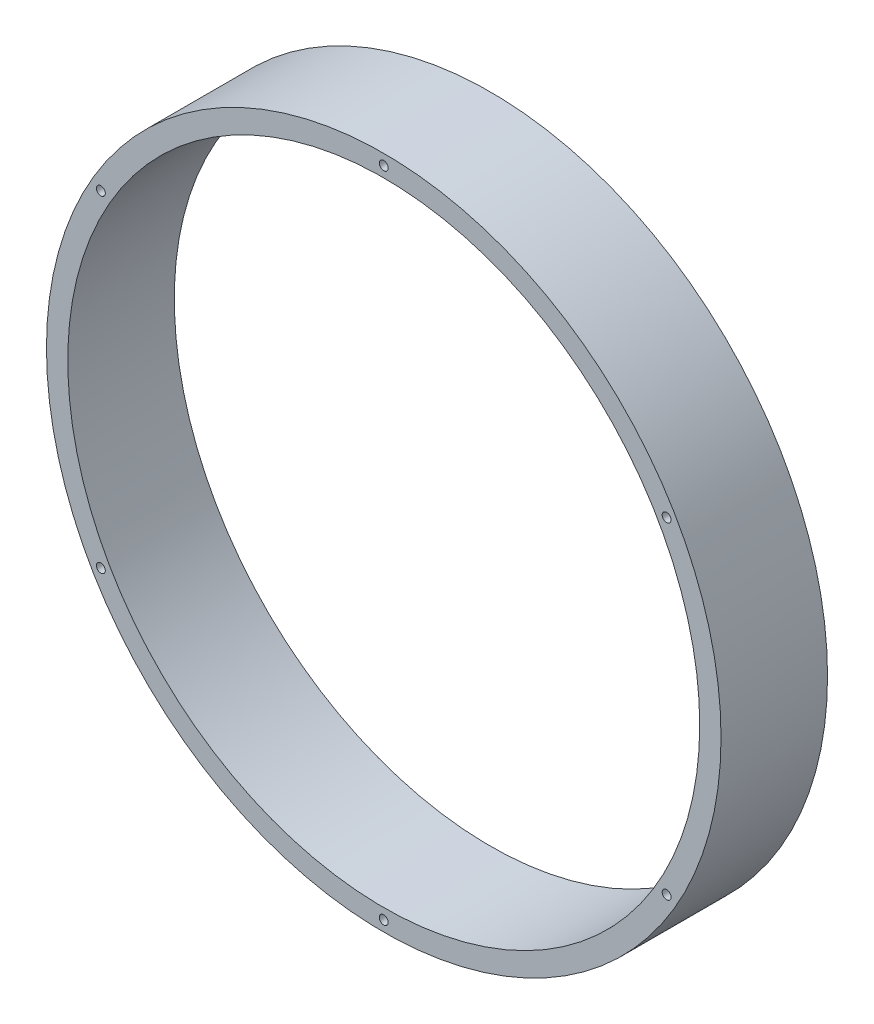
ISO-10303-21;
HEADER;
FILE_DESCRIPTION(('STEP AP214'),'2;1');
FILE_NAME('part.step','',(''),(''),'','','');
FILE_SCHEMA(('AUTOMOTIVE_DESIGN { 1 0 10303 214 1 1 1 1 }'));
ENDSEC;
DATA;
#1=APPLICATION_CONTEXT('core data for automotive mechanical design processes');
#2=APPLICATION_PROTOCOL_DEFINITION('international standard','automotive_design',2000,#1);
#3=PRODUCT_CONTEXT('',#1,'mechanical');
#4=PRODUCT('Part','Part','',(#3));
#5=PRODUCT_RELATED_PRODUCT_CATEGORY('part','',(#4));
#6=PRODUCT_DEFINITION_FORMATION('','',#4);
#7=PRODUCT_DEFINITION_CONTEXT('part definition',#1,'design');
#8=PRODUCT_DEFINITION('design','',#6,#7);
#9=PRODUCT_DEFINITION_SHAPE('','',#8);
#10=(LENGTH_UNIT() NAMED_UNIT(*) SI_UNIT(.MILLI.,.METRE.));
#11=(NAMED_UNIT(*) PLANE_ANGLE_UNIT() SI_UNIT($,.RADIAN.));
#12=(NAMED_UNIT(*) SI_UNIT($,.STERADIAN.) SOLID_ANGLE_UNIT());
#13=UNCERTAINTY_MEASURE_WITH_UNIT(LENGTH_MEASURE(1.E-05),#10,'distance_accuracy_value','');
#14=(GEOMETRIC_REPRESENTATION_CONTEXT(3) GLOBAL_UNCERTAINTY_ASSIGNED_CONTEXT((#13)) GLOBAL_UNIT_ASSIGNED_CONTEXT((#10,
#11,#12)) REPRESENTATION_CONTEXT('',''));
#15=CARTESIAN_POINT('',(0.,0.,0.));
#16=DIRECTION('',(0.,0.,1.));
#17=DIRECTION('',(1.,0.,0.));
#18=AXIS2_PLACEMENT_3D('',#15,#16,#17);
#19=CARTESIAN_POINT('',(0.,0.,30.));
#20=DIRECTION('',(0.,0.,1.));
#21=DIRECTION('',(1.,0.,0.));
#22=AXIS2_PLACEMENT_3D('',#19,#20,#21);
#23=PLANE('',#22);
#24=CARTESIAN_POINT('',(0.,92.,30.));
#25=DIRECTION('',(0.,0.,1.));
#26=DIRECTION('',(1.,0.,0.));
#27=AXIS2_PLACEMENT_3D('',#24,#25,#26);
#28=CIRCLE('',#27,1.25);
#29=CARTESIAN_POINT('',(1.25,92.,30.));
#30=VERTEX_POINT('',#29);
#31=EDGE_CURVE('E93',#30,#30,#28,.T.);
#32=ORIENTED_EDGE('',*,*,#31,.F.);
#33=EDGE_LOOP('',(#32));
#34=FACE_BOUND('',#33,.T.);
#35=CARTESIAN_POINT('',(-79.6743371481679,46.0000000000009,30.));
#36=DIRECTION('',(0.,0.,1.));
#37=DIRECTION('',(1.,0.,0.));
#38=AXIS2_PLACEMENT_3D('',#35,#36,#37);
#39=CIRCLE('',#38,1.25);
#40=CARTESIAN_POINT('',(-78.4243371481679,46.0000000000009,30.));
#41=VERTEX_POINT('',#40);
#42=EDGE_CURVE('E70',#41,#41,#39,.T.);
#43=ORIENTED_EDGE('',*,*,#42,.F.);
#44=EDGE_LOOP('',(#43));
#45=FACE_BOUND('',#44,.T.);
#46=CARTESIAN_POINT('',(-79.6743371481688,-45.9999999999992,30.));
#47=DIRECTION('',(0.,0.,1.));
#48=DIRECTION('',(1.,0.,0.));
#49=AXIS2_PLACEMENT_3D('',#46,#47,#48);
#50=CIRCLE('',#49,1.25);
#51=CARTESIAN_POINT('',(-78.4243371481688,-45.9999999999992,30.));
#52=VERTEX_POINT('',#51);
#53=EDGE_CURVE('E68',#52,#52,#50,.T.);
#54=ORIENTED_EDGE('',*,*,#53,.F.);
#55=EDGE_LOOP('',(#54));
#56=FACE_BOUND('',#55,.T.);
#57=CARTESIAN_POINT('',(-6.42432566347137E-13,-92.,30.));
#58=DIRECTION('',(0.,0.,1.));
#59=DIRECTION('',(1.,0.,0.));
#60=AXIS2_PLACEMENT_3D('',#57,#58,#59);
#61=CIRCLE('',#60,1.25);
#62=CARTESIAN_POINT('',(1.24999999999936,-92.,30.));
#63=VERTEX_POINT('',#62);
#64=EDGE_CURVE('E78',#63,#63,#61,.T.);
#65=ORIENTED_EDGE('',*,*,#64,.F.);
#66=EDGE_LOOP('',(#65));
#67=FACE_BOUND('',#66,.T.);
#68=CARTESIAN_POINT('',(79.6743371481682,-46.0000000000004,30.));
#69=DIRECTION('',(0.,0.,1.));
#70=DIRECTION('',(1.,0.,0.));
#71=AXIS2_PLACEMENT_3D('',#68,#69,#70);
#72=CIRCLE('',#71,1.25000000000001);
#73=CARTESIAN_POINT('',(80.9243371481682,-46.0000000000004,30.));
#74=VERTEX_POINT('',#73);
#75=EDGE_CURVE('E82',#74,#74,#72,.T.);
#76=ORIENTED_EDGE('',*,*,#75,.F.);
#77=EDGE_LOOP('',(#76));
#78=FACE_BOUND('',#77,.T.);
#79=CARTESIAN_POINT('',(79.6743371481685,45.9999999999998,30.));
#80=DIRECTION('',(0.,0.,1.));
#81=DIRECTION('',(1.,0.,0.));
#82=AXIS2_PLACEMENT_3D('',#79,#80,#81);
#83=CIRCLE('',#82,1.25);
#84=CARTESIAN_POINT('',(80.9243371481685,45.9999999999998,30.));
#85=VERTEX_POINT('',#84);
#86=EDGE_CURVE('E86',#85,#85,#83,.T.);
#87=ORIENTED_EDGE('',*,*,#86,.F.);
#88=EDGE_LOOP('',(#87));
#89=FACE_BOUND('',#88,.T.);
#90=CARTESIAN_POINT('',(0.,0.,30.));
#91=DIRECTION('',(0.,0.,1.));
#92=DIRECTION('',(1.,0.,0.));
#93=AXIS2_PLACEMENT_3D('',#90,#91,#92);
#94=CIRCLE('',#93,95.);
#95=CARTESIAN_POINT('',(95.,0.,30.));
#96=VERTEX_POINT('',#95);
#97=EDGE_CURVE('E11',#96,#96,#94,.T.);
#98=ORIENTED_EDGE('',*,*,#97,.T.);
#99=EDGE_LOOP('',(#98));
#100=FACE_BOUND('',#99,.T.);
#101=CARTESIAN_POINT('',(0.,0.,30.));
#102=DIRECTION('',(0.,0.,1.));
#103=DIRECTION('',(1.,0.,0.));
#104=AXIS2_PLACEMENT_3D('',#101,#102,#103);
#105=CIRCLE('',#104,89.);
#106=CARTESIAN_POINT('',(89.,0.,30.));
#107=VERTEX_POINT('',#106);
#108=EDGE_CURVE('E59',#107,#107,#105,.T.);
#109=ORIENTED_EDGE('',*,*,#108,.F.);
#110=EDGE_LOOP('',(#109));
#111=FACE_BOUND('',#110,.T.);
#112=ADVANCED_FACE('F50',(#34,#45,#56,#67,#78,#89,#100,#111),#23,.T.);
#113=CARTESIAN_POINT('',(0.,0.,0.));
#114=DIRECTION('',(0.,0.,1.));
#115=DIRECTION('',(1.,0.,0.));
#116=AXIS2_PLACEMENT_3D('',#113,#114,#115);
#117=PLANE('',#116);
#118=CARTESIAN_POINT('',(0.,0.,0.));
#119=DIRECTION('',(0.,0.,1.));
#120=DIRECTION('',(1.,0.,0.));
#121=AXIS2_PLACEMENT_3D('',#118,#119,#120);
#122=CIRCLE('',#121,95.);
#123=CARTESIAN_POINT('',(95.,0.,0.));
#124=VERTEX_POINT('',#123);
#125=EDGE_CURVE('E51',#124,#124,#122,.T.);
#126=ORIENTED_EDGE('',*,*,#125,.F.);
#127=EDGE_LOOP('',(#126));
#128=FACE_BOUND('',#127,.T.);
#129=CARTESIAN_POINT('',(0.,0.,0.));
#130=DIRECTION('',(0.,0.,1.));
#131=DIRECTION('',(1.,0.,0.));
#132=AXIS2_PLACEMENT_3D('',#129,#130,#131);
#133=CIRCLE('',#132,89.);
#134=CARTESIAN_POINT('',(89.,0.,0.));
#135=VERTEX_POINT('',#134);
#136=EDGE_CURVE('E58',#135,#135,#133,.T.);
#137=ORIENTED_EDGE('',*,*,#136,.T.);
#138=EDGE_LOOP('',(#137));
#139=FACE_BOUND('',#138,.T.);
#140=ADVANCED_FACE('F114',(#128,#139),#117,.F.);
#141=CARTESIAN_POINT('',(0.,0.,30.));
#142=DIRECTION('',(0.,0.,-1.));
#143=DIRECTION('',(-1.,0.,0.));
#144=AXIS2_PLACEMENT_3D('',#141,#142,#143);
#145=CYLINDRICAL_SURFACE('',#144,95.);
#146=ORIENTED_EDGE('',*,*,#97,.F.);
#147=EDGE_LOOP('',(#146));
#148=FACE_BOUND('',#147,.T.);
#149=ORIENTED_EDGE('',*,*,#125,.T.);
#150=EDGE_LOOP('',(#149));
#151=FACE_BOUND('',#150,.T.);
#152=ADVANCED_FACE('F47',(#148,#151),#145,.T.);
#153=CARTESIAN_POINT('',(0.,0.,30.));
#154=DIRECTION('',(0.,0.,-1.));
#155=DIRECTION('',(-1.,0.,0.));
#156=AXIS2_PLACEMENT_3D('',#153,#154,#155);
#157=CYLINDRICAL_SURFACE('',#156,89.);
#158=ORIENTED_EDGE('',*,*,#108,.T.);
#159=EDGE_LOOP('',(#158));
#160=FACE_BOUND('',#159,.T.);
#161=ORIENTED_EDGE('',*,*,#136,.F.);
#162=EDGE_LOOP('',(#161));
#163=FACE_BOUND('',#162,.T.);
#164=ADVANCED_FACE('F130',(#160,#163),#157,.F.);
#165=CARTESIAN_POINT('',(79.6743371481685,45.9999999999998,20.));
#166=DIRECTION('',(0.,0.,1.));
#167=DIRECTION('',(1.,0.,0.));
#168=AXIS2_PLACEMENT_3D('',#165,#166,#167);
#169=CYLINDRICAL_SURFACE('',#168,1.25);
#170=CARTESIAN_POINT('',(79.6743371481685,45.9999999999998,20.));
#171=DIRECTION('',(0.,0.,1.));
#172=DIRECTION('',(1.,0.,0.));
#173=AXIS2_PLACEMENT_3D('',#170,#171,#172);
#174=CIRCLE('',#173,1.25);
#175=CARTESIAN_POINT('',(80.9243371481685,45.9999999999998,20.));
#176=VERTEX_POINT('',#175);
#177=EDGE_CURVE('E85',#176,#176,#174,.T.);
#178=ORIENTED_EDGE('',*,*,#177,.F.);
#179=EDGE_LOOP('',(#178));
#180=FACE_BOUND('',#179,.T.);
#181=ORIENTED_EDGE('',*,*,#86,.T.);
#182=EDGE_LOOP('',(#181));
#183=FACE_BOUND('',#182,.T.);
#184=ADVANCED_FACE('F128',(#180,#183),#169,.F.);
#185=CARTESIAN_POINT('',(79.6743371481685,45.9999999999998,20.));
#186=DIRECTION('',(0.,0.,1.));
#187=DIRECTION('',(1.,0.,0.));
#188=AXIS2_PLACEMENT_3D('',#185,#186,#187);
#189=PLANE('',#188);
#190=ORIENTED_EDGE('',*,*,#177,.T.);
#191=EDGE_LOOP('',(#190));
#192=FACE_BOUND('',#191,.T.);
#193=ADVANCED_FACE('F167',(#192),#189,.T.);
#194=CARTESIAN_POINT('',(79.6743371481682,-46.0000000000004,20.));
#195=DIRECTION('',(0.,0.,1.));
#196=DIRECTION('',(1.,0.,0.));
#197=AXIS2_PLACEMENT_3D('',#194,#195,#196);
#198=CYLINDRICAL_SURFACE('',#197,1.25000000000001);
#199=CARTESIAN_POINT('',(79.6743371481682,-46.0000000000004,20.));
#200=DIRECTION('',(0.,0.,1.));
#201=DIRECTION('',(1.,0.,0.));
#202=AXIS2_PLACEMENT_3D('',#199,#200,#201);
#203=CIRCLE('',#202,1.25000000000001);
#204=CARTESIAN_POINT('',(80.9243371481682,-46.0000000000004,20.));
#205=VERTEX_POINT('',#204);
#206=EDGE_CURVE('E79',#205,#205,#203,.T.);
#207=ORIENTED_EDGE('',*,*,#206,.F.);
#208=EDGE_LOOP('',(#207));
#209=FACE_BOUND('',#208,.T.);
#210=ORIENTED_EDGE('',*,*,#75,.T.);
#211=EDGE_LOOP('',(#210));
#212=FACE_BOUND('',#211,.T.);
#213=ADVANCED_FACE('F165',(#209,#212),#198,.F.);
#214=CARTESIAN_POINT('',(79.6743371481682,-46.0000000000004,20.));
#215=DIRECTION('',(0.,0.,1.));
#216=DIRECTION('',(1.,0.,0.));
#217=AXIS2_PLACEMENT_3D('',#214,#215,#216);
#218=PLANE('',#217);
#219=ORIENTED_EDGE('',*,*,#206,.T.);
#220=EDGE_LOOP('',(#219));
#221=FACE_BOUND('',#220,.T.);
#222=ADVANCED_FACE('F158',(#221),#218,.T.);
#223=CARTESIAN_POINT('',(-6.42432566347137E-13,-92.,20.));
#224=DIRECTION('',(0.,0.,1.));
#225=DIRECTION('',(1.,0.,0.));
#226=AXIS2_PLACEMENT_3D('',#223,#224,#225);
#227=CYLINDRICAL_SURFACE('',#226,1.25);
#228=CARTESIAN_POINT('',(-6.42432566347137E-13,-92.,20.));
#229=DIRECTION('',(0.,0.,1.));
#230=DIRECTION('',(1.,0.,0.));
#231=AXIS2_PLACEMENT_3D('',#228,#229,#230);
#232=CIRCLE('',#231,1.25);
#233=CARTESIAN_POINT('',(1.24999999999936,-92.,20.));
#234=VERTEX_POINT('',#233);
#235=EDGE_CURVE('E71',#234,#234,#232,.T.);
#236=ORIENTED_EDGE('',*,*,#235,.F.);
#237=EDGE_LOOP('',(#236));
#238=FACE_BOUND('',#237,.T.);
#239=ORIENTED_EDGE('',*,*,#64,.T.);
#240=EDGE_LOOP('',(#239));
#241=FACE_BOUND('',#240,.T.);
#242=ADVANCED_FACE('F152',(#238,#241),#227,.F.);
#243=CARTESIAN_POINT('',(-6.42432566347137E-13,-92.,20.));
#244=DIRECTION('',(0.,0.,1.));
#245=DIRECTION('',(1.,0.,0.));
#246=AXIS2_PLACEMENT_3D('',#243,#244,#245);
#247=PLANE('',#246);
#248=ORIENTED_EDGE('',*,*,#235,.T.);
#249=EDGE_LOOP('',(#248));
#250=FACE_BOUND('',#249,.T.);
#251=ADVANCED_FACE('F147',(#250),#247,.T.);
#252=CARTESIAN_POINT('',(-79.6743371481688,-45.9999999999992,20.));
#253=DIRECTION('',(0.,0.,1.));
#254=DIRECTION('',(1.,0.,0.));
#255=AXIS2_PLACEMENT_3D('',#252,#253,#254);
#256=CYLINDRICAL_SURFACE('',#255,1.25);
#257=CARTESIAN_POINT('',(-79.6743371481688,-45.9999999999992,20.));
#258=DIRECTION('',(0.,0.,1.));
#259=DIRECTION('',(1.,0.,0.));
#260=AXIS2_PLACEMENT_3D('',#257,#258,#259);
#261=CIRCLE('',#260,1.25);
#262=CARTESIAN_POINT('',(-78.4243371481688,-45.9999999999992,20.));
#263=VERTEX_POINT('',#262);
#264=EDGE_CURVE('E66',#263,#263,#261,.T.);
#265=ORIENTED_EDGE('',*,*,#264,.F.);
#266=EDGE_LOOP('',(#265));
#267=FACE_BOUND('',#266,.T.);
#268=ORIENTED_EDGE('',*,*,#53,.T.);
#269=EDGE_LOOP('',(#268));
#270=FACE_BOUND('',#269,.T.);
#271=ADVANCED_FACE('F148',(#267,#270),#256,.F.);
#272=CARTESIAN_POINT('',(-79.6743371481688,-45.9999999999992,20.));
#273=DIRECTION('',(0.,0.,1.));
#274=DIRECTION('',(1.,0.,0.));
#275=AXIS2_PLACEMENT_3D('',#272,#273,#274);
#276=PLANE('',#275);
#277=ORIENTED_EDGE('',*,*,#264,.T.);
#278=EDGE_LOOP('',(#277));
#279=FACE_BOUND('',#278,.T.);
#280=ADVANCED_FACE('F142',(#279),#276,.T.);
#281=CARTESIAN_POINT('',(-79.6743371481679,46.0000000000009,20.));
#282=DIRECTION('',(0.,0.,1.));
#283=DIRECTION('',(1.,0.,0.));
#284=AXIS2_PLACEMENT_3D('',#281,#282,#283);
#285=CYLINDRICAL_SURFACE('',#284,1.25);
#286=CARTESIAN_POINT('',(-79.6743371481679,46.0000000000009,20.));
#287=DIRECTION('',(0.,0.,1.));
#288=DIRECTION('',(1.,0.,0.));
#289=AXIS2_PLACEMENT_3D('',#286,#287,#288);
#290=CIRCLE('',#289,1.25);
#291=CARTESIAN_POINT('',(-78.4243371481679,46.0000000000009,20.));
#292=VERTEX_POINT('',#291);
#293=EDGE_CURVE('E95',#292,#292,#290,.T.);
#294=ORIENTED_EDGE('',*,*,#293,.F.);
#295=EDGE_LOOP('',(#294));
#296=FACE_BOUND('',#295,.T.);
#297=ORIENTED_EDGE('',*,*,#42,.T.);
#298=EDGE_LOOP('',(#297));
#299=FACE_BOUND('',#298,.T.);
#300=ADVANCED_FACE('F144',(#296,#299),#285,.F.);
#301=CARTESIAN_POINT('',(-79.6743371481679,46.0000000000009,20.));
#302=DIRECTION('',(0.,0.,1.));
#303=DIRECTION('',(1.,0.,0.));
#304=AXIS2_PLACEMENT_3D('',#301,#302,#303);
#305=PLANE('',#304);
#306=ORIENTED_EDGE('',*,*,#293,.T.);
#307=EDGE_LOOP('',(#306));
#308=FACE_BOUND('',#307,.T.);
#309=ADVANCED_FACE('F110',(#308),#305,.T.);
#310=CARTESIAN_POINT('',(0.,92.,20.));
#311=DIRECTION('',(0.,0.,1.));
#312=DIRECTION('',(1.,0.,0.));
#313=AXIS2_PLACEMENT_3D('',#310,#311,#312);
#314=CYLINDRICAL_SURFACE('',#313,1.25);
#315=CARTESIAN_POINT('',(0.,92.,20.));
#316=DIRECTION('',(0.,0.,1.));
#317=DIRECTION('',(1.,0.,0.));
#318=AXIS2_PLACEMENT_3D('',#315,#316,#317);
#319=CIRCLE('',#318,1.25);
#320=CARTESIAN_POINT('',(1.25,92.,20.));
#321=VERTEX_POINT('',#320);
#322=EDGE_CURVE('E61',#321,#321,#319,.T.);
#323=ORIENTED_EDGE('',*,*,#322,.F.);
#324=EDGE_LOOP('',(#323));
#325=FACE_BOUND('',#324,.T.);
#326=ORIENTED_EDGE('',*,*,#31,.T.);
#327=EDGE_LOOP('',(#326));
#328=FACE_BOUND('',#327,.T.);
#329=ADVANCED_FACE('F102',(#325,#328),#314,.F.);
#330=CARTESIAN_POINT('',(0.,92.,20.));
#331=DIRECTION('',(0.,0.,1.));
#332=DIRECTION('',(1.,0.,0.));
#333=AXIS2_PLACEMENT_3D('',#330,#331,#332);
#334=PLANE('',#333);
#335=ORIENTED_EDGE('',*,*,#322,.T.);
#336=EDGE_LOOP('',(#335));
#337=FACE_BOUND('',#336,.T.);
#338=ADVANCED_FACE('F105',(#337),#334,.T.);
#339=CLOSED_SHELL('',(#112,#140,#152,#164,#184,#193,#213,#222,#242,#251,#271,#280,#300,#309,
#329,#338));
#340=MANIFOLD_SOLID_BREP('B2',#339);
#341=ADVANCED_BREP_SHAPE_REPRESENTATION('',(#18,#340),#14);
#342=SHAPE_DEFINITION_REPRESENTATION(#9,#341);
ENDSEC;
END-ISO-10303-21;
